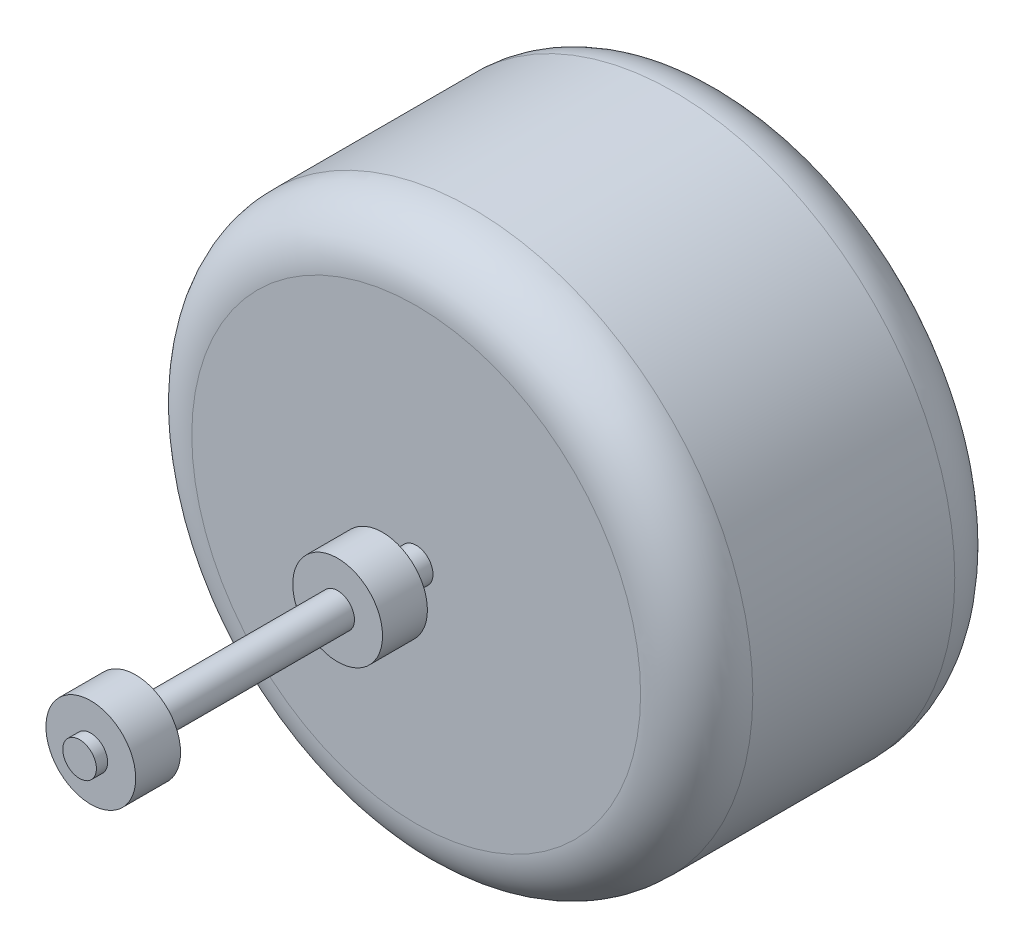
from build123d import *

# Parameters (mm, degrees)
SKETCH1_R           = 25
BOSS_EXTRUDE1_DEPTH = 14
FILLET1_R           = 5
SKETCH2_R           = 1.5
BOSS_EXTRUDE2_DEPTH = 30
BOSS_EXTRUDE3_START = -1
SKETCH3_R           = 4
BOSS_EXTRUDE3_DEPTH = 4
BOSS_EXTRUDE4_START = -23
SKETCH3_2_R         = 4
BOSS_EXTRUDE4_DEPTH = 4


with BuildPart() as part:
    # Sketch1 → Boss-Extrude1 (new, symmetric)
    with BuildSketch(Plane.XY):
        Circle(SKETCH1_R)
    extrude(amount=BOSS_EXTRUDE1_DEPTH, both=True)

    # Fillet1
    fillet1_edges = [part.edges().sort_by_distance(p)[0] for p in [
        (-25, 0, -14),
        (-25, 0, 14),
    ]]
    fillet(fillet1_edges, radius=FILLET1_R)

    # Sketch2 → Boss-Extrude2 (add)
    with BuildSketch(Plane.XY.offset(14)):
        Circle(SKETCH2_R)
    extrude(amount=BOSS_EXTRUDE2_DEPTH)

    # Sketch3 → Boss-Extrude3 (add)
    with BuildSketch(Plane.XY.offset(44).offset(BOSS_EXTRUDE3_START)):
        Circle(SKETCH3_R)
    extrude(amount=-BOSS_EXTRUDE3_DEPTH)

    # Sketch3_2 → Boss-Extrude4 (add)
    with BuildSketch(Plane.XY.offset(44).offset(BOSS_EXTRUDE4_START)):
        Circle(SKETCH3_2_R)
    extrude(amount=-BOSS_EXTRUDE4_DEPTH)


solid = part.part
